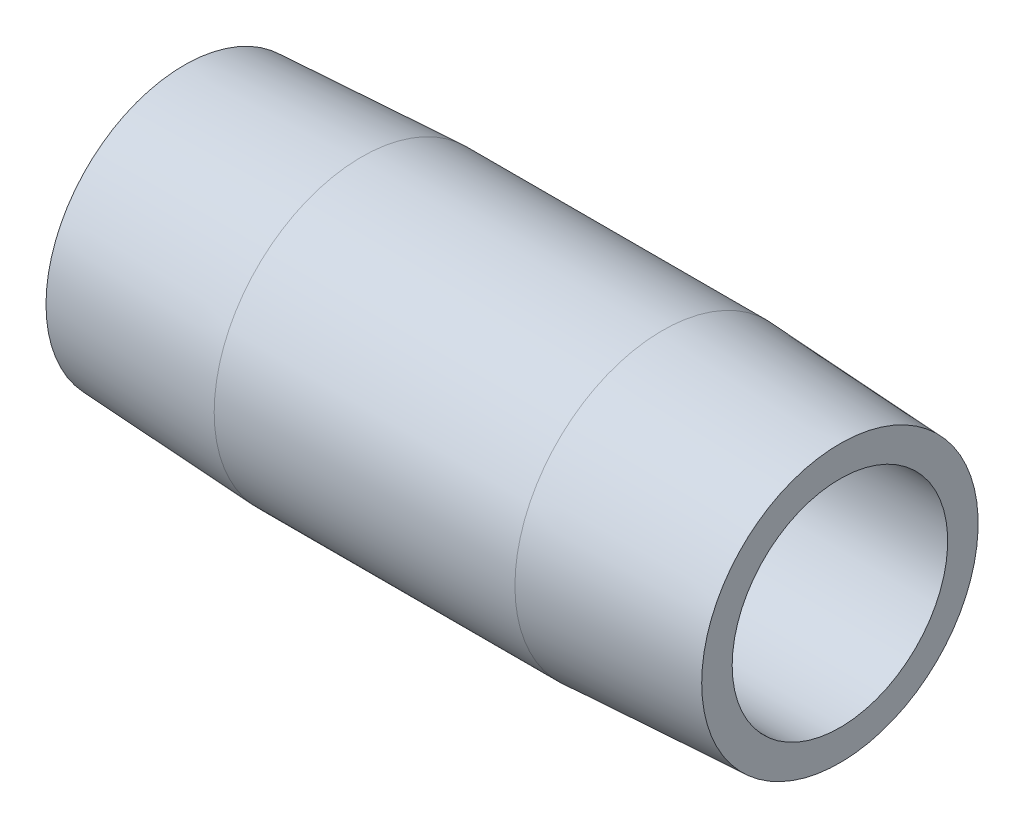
from build123d import *


with BuildPart() as part:
    # Sketch1 → Revolve1 (revolve)
    with BuildSketch(Plane.XY, mode=Mode.PRIVATE) as revolve1_sk:
        Polygon((38.1, 6.2611), (0, 6.2611), (0, 8.032050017), (10.3124, 8.5725), (27.7876, 8.5725), (38.1, 8.032050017), align=None)
    revolve(revolve1_sk.sketch.rotate(Axis((0, 0, 0), (1, 0, 0)), 90), axis=Axis((0, 0, 0), (1, 0, 0)))


solid = part.part
